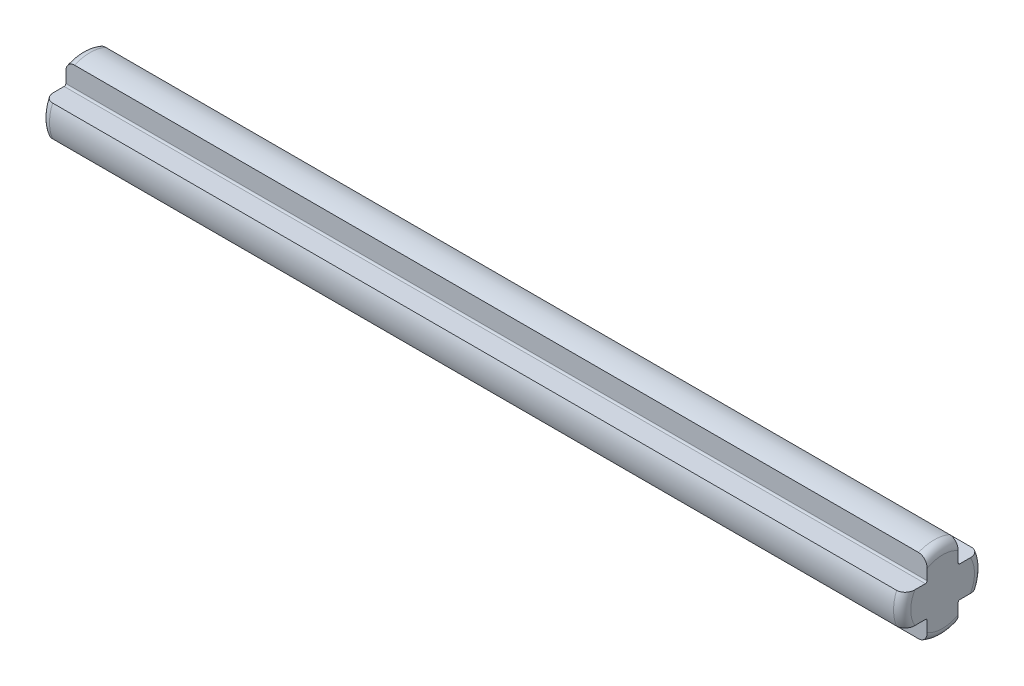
from build123d import *

# Parameters (mm, degrees)
EXTRUIR1_DEPTH = 25
REDONDEO1_R    = 0.5


with BuildPart() as part:
    # Croquis1 → Extruir1 (new, symmetric)
    with BuildSketch(Plane(origin=(0, 0, 0), x_dir=(0, 0, -1), z_dir=(1, 0, 0))):
        with BuildLine():
            Line((-0.9, 2.170829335), (-0.9, 1))
            ThreePointArc((-0.9, 1), (-0.929289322, 0.929289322), (-1, 0.9))
            Line((-1, 0.9), (-2.170829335, 0.9))
            ThreePointArc((-2.170829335, 0.9), (-2.35, 0), (-2.170829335, -0.9))
            Line((-2.170829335, -0.9), (-1, -0.9))
            ThreePointArc((-1, -0.9), (-0.929289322, -0.929289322), (-0.9, -1))
            Line((-0.9, -1), (-0.9, -2.170829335))
            ThreePointArc((-0.9, -2.170829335), (0, -2.35), (0.9, -2.170829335))
            Line((0.9, -2.170829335), (0.9, -1))
            ThreePointArc((0.9, -1), (0.929289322, -0.929289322), (1, -0.9))
            Line((1, -0.9), (2.170829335, -0.9))
            ThreePointArc((2.170829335, -0.9), (2.35, 0), (2.170829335, 0.9))
            Line((2.170829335, 0.9), (1, 0.9))
            ThreePointArc((1, 0.9), (0.929289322, 0.929289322), (0.9, 1))
            Line((0.9, 1), (0.9, 2.170829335))
            ThreePointArc((0.9, 2.170829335), (0, 2.35), (-0.9, 2.170829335))
        make_face()
    extrude(amount=EXTRUIR1_DEPTH, both=True)

    # Redondeo1
    redondeo1_edges = [part.edges().sort_by_distance(p)[0] for p in [
        (-25, 2.35, 0),
        (25, -2.35, 0),
        (-25, 0, -2.35),
        (-25, -2.35, 0),
        (-25, 0, 2.35),
        (25, 0, -2.35),
        (25, 0, 2.35),
        (25, 2.35, 0),
    ]]
    fillet(redondeo1_edges, radius=REDONDEO1_R)


solid = part.part
